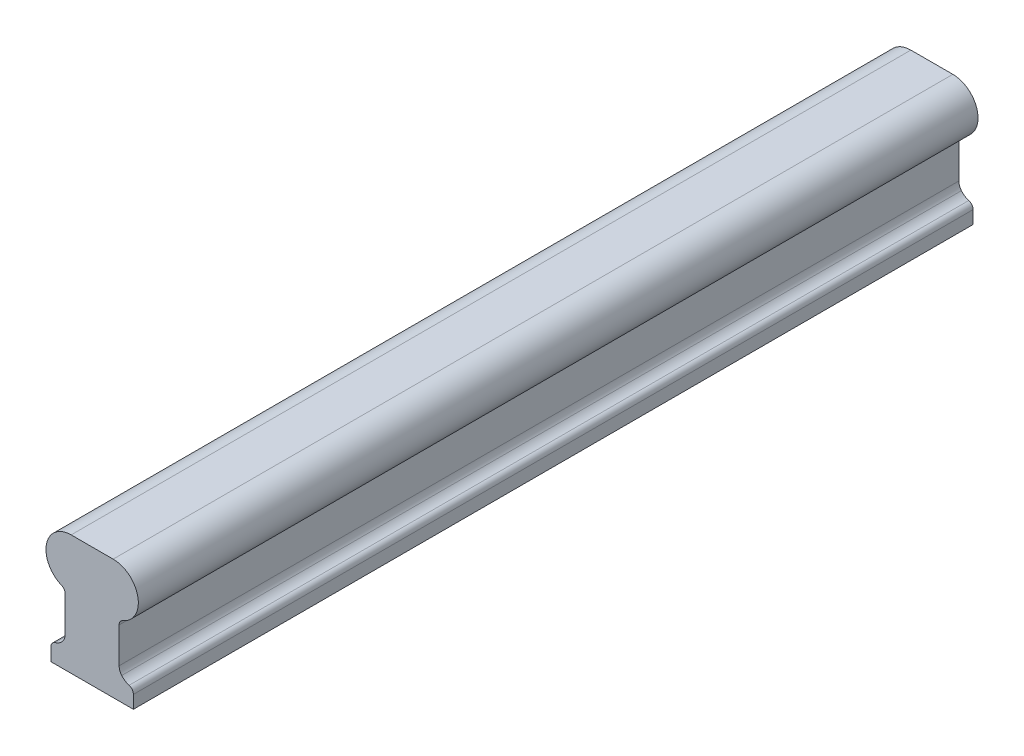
from build123d import *

# Parameters (mm, degrees)
BASE_EXTRUDE_DEPTH = 355.6


with BuildPart() as part:
    # Sketch1 → Base-Extrude (new body)
    with BuildSketch(Plane.XY):
        with BuildLine():
            Line((0, 0), (34.925, 0))
            Line((34.925, 0), (34.925, 5.470090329))
            ThreePointArc((34.925, 5.470090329), (34.41915145, 6.991217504), (33.103088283, 7.906470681))
            ThreePointArc((33.103088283, 7.906470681), (31.394911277, 8.696422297), (29.987795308, 9.946189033))
            ThreePointArc((29.987795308, 9.946189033), (29.174834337, 11.354573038), (28.8925, 12.956053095))
            Line((28.8925, 12.956053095), (28.8925, 27.94))
            ThreePointArc((28.8925, 27.94), (29.319092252, 29.348938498), (30.455576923, 30.284615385))
            ThreePointArc((30.455576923, 30.284615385), (36.813334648, 42.22416693), (26.3525, 50.8))
            Line((26.3525, 50.8), (8.5725, 50.8))
            ThreePointArc((8.5725, 50.8), (-1.888334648, 42.22416693), (4.469423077, 30.284615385))
            ThreePointArc((4.469423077, 30.284615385), (5.605907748, 29.348938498), (6.0325, 27.94))
            Line((6.0325, 27.94), (6.0325, 12.956053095))
            ThreePointArc((6.0325, 12.956053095), (5.750165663, 11.354573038), (4.937204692, 9.946189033))
            ThreePointArc((4.937204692, 9.946189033), (3.530088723, 8.696422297), (1.821911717, 7.906470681))
            ThreePointArc((1.821911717, 7.906470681), (0.50584855, 6.991217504), (0, 5.470090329))
            Line((0, 5.470090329), (0, 0))
        make_face()
    extrude(amount=BASE_EXTRUDE_DEPTH)


solid = part.part
